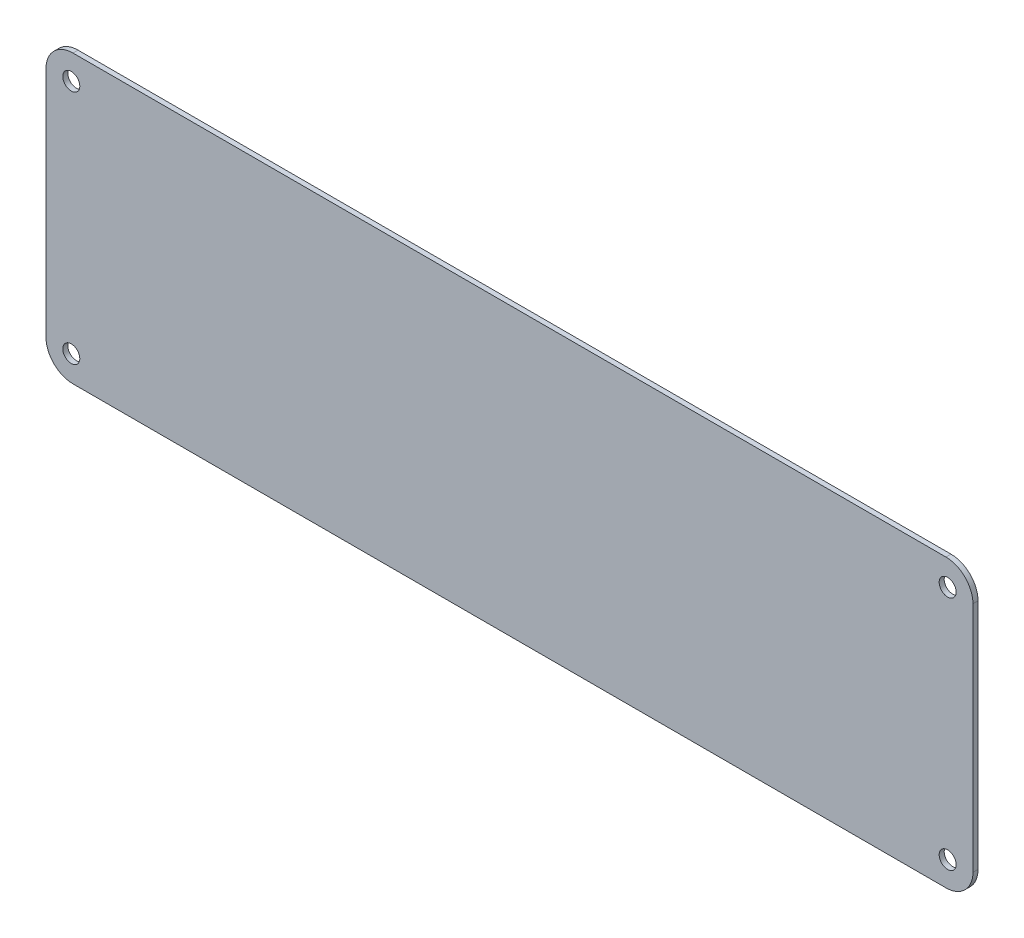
from build123d import *

# Parameters (mm, degrees)
SKIZZE1_W                          = 275
SKIZZE1_H                          = 85
AUFSATZ_LINEAR_AUSTRAGEN1_DEPTH    = 1.5
F_5_05_5_05_DURCHMESSER_BOHRUNG1_D = 5.05
VERRUNDUNG1_R                      = 8


with BuildPart() as part:
    # Skizze1 → Aufsatz-Linear austragen1 (new body)
    with BuildSketch(Plane.XY):
        Rectangle(SKIZZE1_W, SKIZZE1_H)
    extrude(amount=AUFSATZ_LINEAR_AUSTRAGEN1_DEPTH)

    # 5.05 _5.05_ Durchmesser Bohrung1 (through all)
    with Locations(Plane.XY.offset(1.5)):
        with Locations((130, 35), (-130, -35), (-130, 35), (130, -35)):
            Hole(F_5_05_5_05_DURCHMESSER_BOHRUNG1_D / 2)

    # Verrundung1
    verrundung1_edges = [part.edges().sort_by_distance(p)[0] for p in [
        (-137.5, -42.5, 0.75),
        (137.5, -42.5, 0.75),
        (-137.5, 42.5, 0.75),
        (137.5, 42.5, 0.75),
    ]]
    fillet(verrundung1_edges, radius=VERRUNDUNG1_R)


solid = part.part
